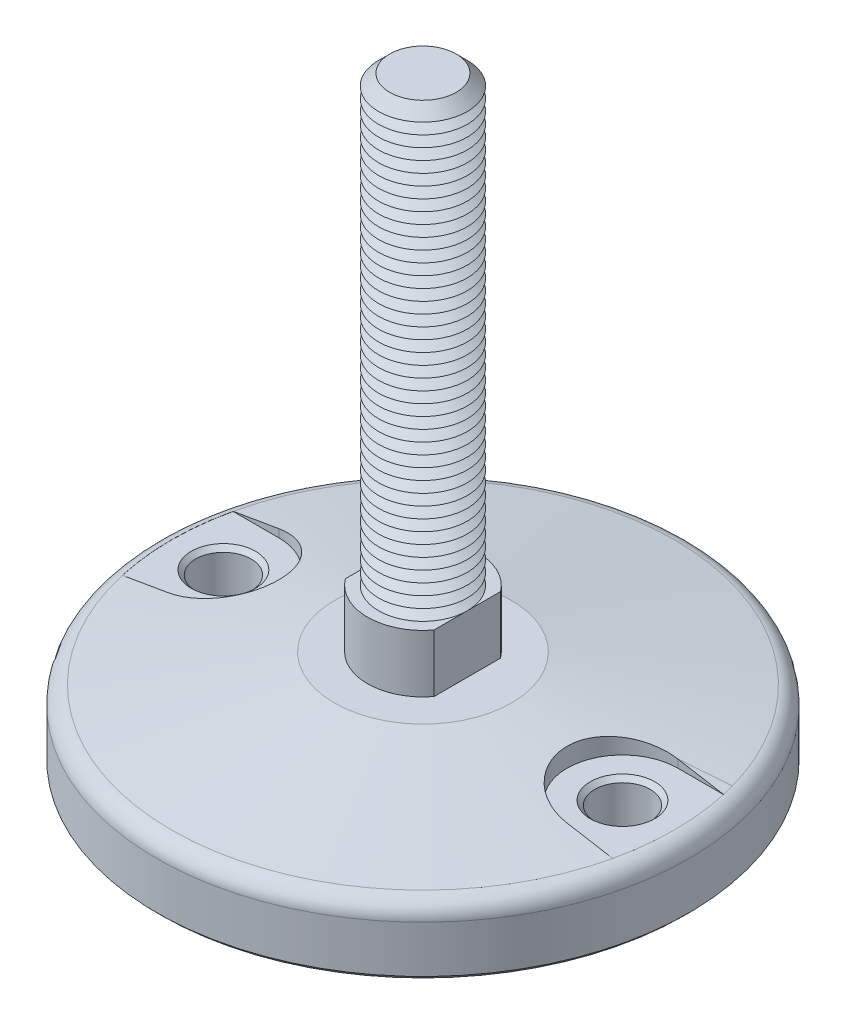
from build123d import *

# Parameters (mm, degrees)
FILLET1_R                = 4
SKETCH3_R                = 12.5
BOSS_EXTRUDE1_DEPTH      = 13
CUT_EXTRUDE1_START       = -13
CUT_EXTRUDE1_DEPTH       = 13
SKETCH5_R                = 10
BOSS_EXTRUDE2_DEPTH      = 100
CHAMFER1_SIZE            = 2.5
LPATTERN1_COUNT          = 39
LPATTERN1_PITCH          = 2.5
CUT_EXTRUDE4_DEPTH       = 6.5
SKETCH10_R               = 6.25
CUT_EXTRUDE5_DEPTH       = 15.5
CHAMFER2_SIZE            = 1
CHAMFER2_OF_MIRROR1_SIZE = 1
CHAMFER3_SIZE            = 1


with BuildPart() as part:
    # Sketch2 → Revolve1 (revolve)
    with BuildSketch(Plane(origin=(0, 0, 0), x_dir=(0, 0, -1), z_dir=(1, 0, 0)), mode=Mode.PRIVATE) as revolve1_sk:
        Polygon((0, 0), (-20, 0), (-60, -7.053079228), (-60, -22), (0, -22), align=None)
    revolve(revolve1_sk.sketch.rotate(Axis((0, 61.338865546, 0), (0, -1, 0)), 180), axis=Axis((0, 61.338865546, 0), (0, -1, 0)))

    # Fillet1
    fillet1_edges = [part.edges().sort_by_distance(p)[0] for p in [
        (0, -7.053079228, 60),
    ]]
    fillet(fillet1_edges, radius=FILLET1_R)

    # Sketch3 → Boss-Extrude1 (add)
    with BuildSketch(Plane(origin=(0, 0, 0), x_dir=(1, 0, 0), z_dir=(0, 1, 0))):
        with Locations(Location((0, 0, 0), (0, 0, 90))):
            Circle(SKETCH3_R)
    extrude(amount=BOSS_EXTRUDE1_DEPTH)

    # Sketch4 → Cut-Extrude1 (cut)
    with BuildSketch(Plane(origin=(0, 13, 0), x_dir=(1, 0, 0), z_dir=(0, 1, 0)).offset(CUT_EXTRUDE1_START)):
        with BuildLine():
            Line((-10, 7.5), (-10, -7.5))
            ThreePointArc((-10, -7.5), (-12.5, 0), (-10, 7.5))
        make_face()
        with BuildLine():
            Line((10, -7.5), (10, 7.5))
            ThreePointArc((10, 7.5), (12.5, 0), (10, -7.5))
        make_face()
    extrude(amount=CUT_EXTRUDE1_DEPTH, mode=Mode.SUBTRACT)

    # Sketch5 → Boss-Extrude2 (add)
    with BuildSketch(Plane(origin=(0, 13, 0), x_dir=(1, 0, 0), z_dir=(0, 1, 0))):
        with Locations(Location((0, 0, 0), (0, 0, 180))):
            Circle(SKETCH5_R)
    extrude(amount=BOSS_EXTRUDE2_DEPTH)

    # Chamfer1
    chamfer1_edges = [part.edges().sort_by_distance(p)[0] for p in [
        (10, 113, 0),
    ]]
    chamfer(chamfer1_edges, length=CHAMFER1_SIZE)

    # Sketch6 → Cut-Revolve1 (revolve, cut)
    with BuildSketch(Plane(origin=(0, 0, 0), x_dir=(0, 0, -1), z_dir=(1, 0, 0))):
        Polygon((-10, 13), (-7.834936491, 14.25), (-10, 15.5), align=None)
    cut_revolve1 = revolve(axis=Axis((0, 61.338865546, 0), (0, -1, 0)), mode=Mode.SUBTRACT)

    # LPattern1: Cut-Revolve1 ×39
    with Locations(*[(0, i * LPATTERN1_PITCH, 0) for i in range(1, LPATTERN1_COUNT)]):
        add(cut_revolve1, mode=Mode.SUBTRACT)

    # Sketch8 → Cut-Extrude4 (cut)
    with BuildSketch(Plane(origin=(0, 0, 0), x_dir=(1, 0, 0), z_dir=(0, 1, 0))):
        with BuildLine():
            Line((-45, 12.5), (-55.299428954, 12.5))
            ThreePointArc((-55.299428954, 12.5), (-56.694592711, 0), (-55.299428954, -12.5))
            Line((-55.299428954, -12.5), (-45, -12.5))
            ThreePointArc((-45, -12.5), (-32.5, 0), (-45, 12.5))
        make_face()
    cut_extrude4 = extrude(amount=-CUT_EXTRUDE4_DEPTH, mode=Mode.SUBTRACT)

    # Sketch10 → Cut-Extrude5 (cut)
    with BuildSketch(Plane(origin=(0, -6.5, 0), x_dir=(1, 0, 0), z_dir=(0, 1, 0))):
        with Locations(Location((-45, 0, 0), (0, 0, 270))):
            Circle(SKETCH10_R)
    cut_extrude5 = extrude(amount=-CUT_EXTRUDE5_DEPTH, mode=Mode.SUBTRACT)

    # Chamfer2
    chamfer2_edges = [part.edges().sort_by_distance(p)[0] for p in [
        (-45, -6.5, -6.25),
        (-45, -22, -6.25),
    ]]
    chamfer(chamfer2_edges, length=CHAMFER2_SIZE)

    # Mirror1: Cut-Extrude4, Cut-Extrude5 across plane
    add(cut_extrude4.mirror(Plane(origin=(0, 0, 0), x_dir=(0, 0, 1), z_dir=(1, 0, 0))), mode=Mode.SUBTRACT)
    add(cut_extrude5.mirror(Plane(origin=(0, 0, 0), x_dir=(0, 0, 1), z_dir=(1, 0, 0))), mode=Mode.SUBTRACT)

    # Chamfer2 of Mirror1
    chamfer2_of_mirror1_edges = [part.edges().sort_by_distance(p)[0] for p in [
        (45, -6.5, -6.25),
        (45, -22, -6.25),
    ]]
    chamfer(chamfer2_of_mirror1_edges, length=CHAMFER2_OF_MIRROR1_SIZE)

    # Chamfer3
    chamfer3_edges = [part.edges().sort_by_distance(p)[0] for p in [
        (0, -22, 60),
    ]]
    chamfer(chamfer3_edges, length=CHAMFER3_SIZE)


solid = part.part
